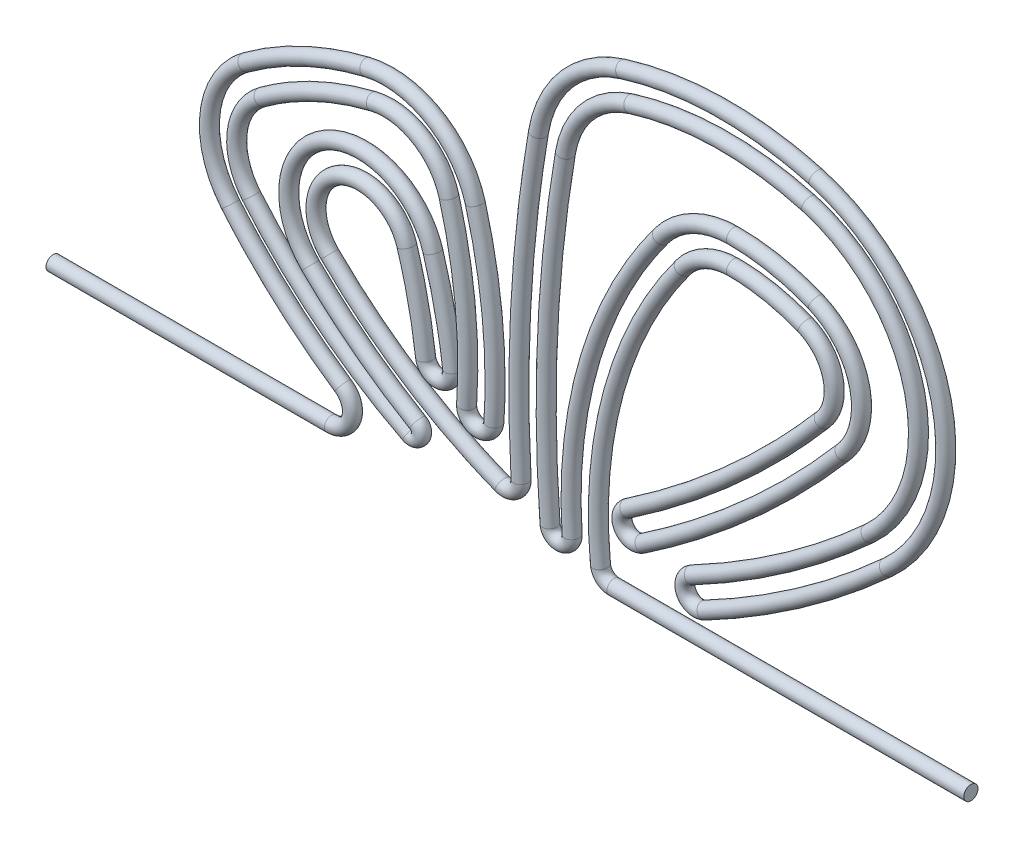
ISO-10303-21;
HEADER;
FILE_DESCRIPTION(('STEP AP214'),'2;1');
FILE_NAME('part.step','',(''),(''),'','','');
FILE_SCHEMA(('AUTOMOTIVE_DESIGN { 1 0 10303 214 1 1 1 1 }'));
ENDSEC;
DATA;
#1=APPLICATION_CONTEXT('core data for automotive mechanical design processes');
#2=APPLICATION_PROTOCOL_DEFINITION('international standard','automotive_design',2000,#1);
#3=PRODUCT_CONTEXT('',#1,'mechanical');
#4=PRODUCT('Part','Part','',(#3));
#5=PRODUCT_RELATED_PRODUCT_CATEGORY('part','',(#4));
#6=PRODUCT_DEFINITION_FORMATION('','',#4);
#7=PRODUCT_DEFINITION_CONTEXT('part definition',#1,'design');
#8=PRODUCT_DEFINITION('design','',#6,#7);
#9=PRODUCT_DEFINITION_SHAPE('','',#8);
#10=(LENGTH_UNIT() NAMED_UNIT(*) SI_UNIT(.MILLI.,.METRE.));
#11=(NAMED_UNIT(*) PLANE_ANGLE_UNIT() SI_UNIT($,.RADIAN.));
#12=(NAMED_UNIT(*) SI_UNIT($,.STERADIAN.) SOLID_ANGLE_UNIT());
#13=UNCERTAINTY_MEASURE_WITH_UNIT(LENGTH_MEASURE(1.E-05),#10,'distance_accuracy_value','');
#14=(GEOMETRIC_REPRESENTATION_CONTEXT(3) GLOBAL_UNCERTAINTY_ASSIGNED_CONTEXT((#13)) GLOBAL_UNIT_ASSIGNED_CONTEXT((#10,
#11,#12)) REPRESENTATION_CONTEXT('',''));
#15=CARTESIAN_POINT('',(0.,0.,0.));
#16=DIRECTION('',(0.,0.,1.));
#17=DIRECTION('',(1.,0.,0.));
#18=AXIS2_PLACEMENT_3D('',#15,#16,#17);
#19=CARTESIAN_POINT('',(-246.494000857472,-180.5,0.));
#20=DIRECTION('',(1.,0.,0.));
#21=DIRECTION('',(0.,1.,0.));
#22=AXIS2_PLACEMENT_3D('',#19,#20,#21);
#23=CYLINDRICAL_SURFACE('',#22,6.49999999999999);
#24=CARTESIAN_POINT('',(80.5,-180.5,0.));
#25=DIRECTION('',(-1.,0.,0.));
#26=DIRECTION('',(0.,-1.,0.));
#27=AXIS2_PLACEMENT_3D('',#24,#25,#26);
#28=CIRCLE('',#27,6.49999999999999);
#29=CARTESIAN_POINT('',(80.5,-187.,0.));
#30=VERTEX_POINT('',#29);
#31=EDGE_CURVE('E49',#30,#30,#28,.T.);
#32=ORIENTED_EDGE('',*,*,#31,.T.);
#33=EDGE_LOOP('',(#32));
#34=FACE_BOUND('',#33,.T.);
#35=CARTESIAN_POINT('',(-246.494000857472,-180.5,0.));
#36=DIRECTION('',(-1.,0.,0.));
#37=DIRECTION('',(0.,-1.,0.));
#38=AXIS2_PLACEMENT_3D('',#35,#36,#37);
#39=CIRCLE('',#38,6.49999999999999);
#40=CARTESIAN_POINT('',(-246.494000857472,-187.,0.));
#41=VERTEX_POINT('',#40);
#42=EDGE_CURVE('E12',#41,#41,#39,.T.);
#43=ORIENTED_EDGE('',*,*,#42,.F.);
#44=EDGE_LOOP('',(#43));
#45=FACE_BOUND('',#44,.T.);
#46=ADVANCED_FACE('F42',(#34,#45),#23,.T.);
#47=CARTESIAN_POINT('',(80.5,-180.5,0.));
#48=DIRECTION('',(-1.,0.,0.));
#49=DIRECTION('',(0.,-1.,0.));
#50=AXIS2_PLACEMENT_3D('',#47,#48,#49);
#51=PLANE('',#50);
#52=ORIENTED_EDGE('',*,*,#31,.F.);
#53=EDGE_LOOP('',(#52));
#54=FACE_BOUND('',#53,.T.);
#55=ADVANCED_FACE('F454',(#54),#51,.F.);
#56=CARTESIAN_POINT('',(-246.494000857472,-168.,0.));
#57=DIRECTION('',(0.,0.,1.));
#58=DIRECTION('',(1.,0.,0.));
#59=AXIS2_PLACEMENT_3D('',#56,#57,#58);
#60=TOROIDAL_SURFACE('',#59,12.5,6.49999999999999);
#61=CARTESIAN_POINT('',(-258.931237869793,-169.251053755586,0.));
#62=DIRECTION('',(-0.100084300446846,0.994978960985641,0.));
#63=DIRECTION('',(-0.994978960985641,-0.100084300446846,0.));
#64=AXIS2_PLACEMENT_3D('',#61,#62,#63);
#65=CIRCLE('',#64,6.49999999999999);
#66=CARTESIAN_POINT('',(-265.398601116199,-169.90160170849,0.));
#67=VERTEX_POINT('',#66);
#68=EDGE_CURVE('E447',#67,#67,#65,.T.);
#69=CARTESIAN_POINT('',(-246.494000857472,-168.,0.));
#70=DIRECTION('',(0.,0.,1.));
#71=DIRECTION('',(1.,0.,0.));
#72=AXIS2_PLACEMENT_3D('',#69,#70,#71);
#73=CIRCLE('',#72,18.9999999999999);
#74=EDGE_CURVE('',#67,#41,#73,.T.);
#75=ORIENTED_EDGE('',*,*,#68,.F.);
#76=ORIENTED_EDGE('',*,*,#42,.T.);
#77=ORIENTED_EDGE('',*,*,#74,.T.);
#78=ORIENTED_EDGE('',*,*,#74,.F.);
#79=EDGE_LOOP('',(#75,#77,#76,#78));
#80=FACE_BOUND('',#79,.T.);
#81=ADVANCED_FACE('F456',(#80),#60,.T.);
#82=CARTESIAN_POINT('',(131.536237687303,-129.974178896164,0.));
#83=DIRECTION('',(0.,0.,1.));
#84=DIRECTION('',(1.,0.,0.));
#85=AXIS2_PLACEMENT_3D('',#82,#83,#84);
#86=TOROIDAL_SURFACE('',#85,392.437921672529,6.49999999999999);
#87=CARTESIAN_POINT('',(-183.05574987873,104.630603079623,0.));
#88=DIRECTION('',(0.597813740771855,0.801635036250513,0.));
#89=DIRECTION('',(-0.801635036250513,0.597813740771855,0.));
#90=AXIS2_PLACEMENT_3D('',#87,#88,#89);
#91=CIRCLE('',#90,6.49999999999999);
#92=CARTESIAN_POINT('',(-188.266377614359,108.51639239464,0.));
#93=VERTEX_POINT('',#92);
#94=EDGE_CURVE('E444',#93,#93,#91,.T.);
#95=CARTESIAN_POINT('',(131.536237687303,-129.974178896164,0.));
#96=DIRECTION('',(0.,0.,1.));
#97=DIRECTION('',(1.,0.,0.));
#98=AXIS2_PLACEMENT_3D('',#95,#96,#97);
#99=CIRCLE('',#98,398.937921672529);
#100=EDGE_CURVE('',#93,#67,#99,.T.);
#101=ORIENTED_EDGE('',*,*,#94,.F.);
#102=ORIENTED_EDGE('',*,*,#68,.T.);
#103=ORIENTED_EDGE('',*,*,#100,.T.);
#104=ORIENTED_EDGE('',*,*,#100,.F.);
#105=EDGE_LOOP('',(#101,#103,#102,#104));
#106=FACE_BOUND('',#105,.T.);
#107=ADVANCED_FACE('F461',(#106),#86,.T.);
#108=CARTESIAN_POINT('',(-136.961735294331,70.2563129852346,0.));
#109=DIRECTION('',(0.,0.,1.));
#110=DIRECTION('',(1.,0.,0.));
#111=AXIS2_PLACEMENT_3D('',#108,#109,#110);
#112=TOROIDAL_SURFACE('',#111,57.5000000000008,6.49999999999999);
#113=CARTESIAN_POINT('',(-136.961735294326,127.756312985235,0.));
#114=DIRECTION('',(1.,0.,0.));
#115=DIRECTION('',(0.,1.,0.));
#116=AXIS2_PLACEMENT_3D('',#113,#114,#115);
#117=CIRCLE('',#116,6.49999999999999);
#118=CARTESIAN_POINT('',(-136.961735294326,134.256312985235,0.));
#119=VERTEX_POINT('',#118);
#120=EDGE_CURVE('E441',#119,#119,#117,.T.);
#121=CARTESIAN_POINT('',(-136.961735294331,70.2563129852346,0.));
#122=DIRECTION('',(0.,0.,1.));
#123=DIRECTION('',(1.,0.,0.));
#124=AXIS2_PLACEMENT_3D('',#121,#122,#123);
#125=CIRCLE('',#124,64.0000000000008);
#126=EDGE_CURVE('',#119,#93,#125,.T.);
#127=ORIENTED_EDGE('',*,*,#120,.F.);
#128=ORIENTED_EDGE('',*,*,#94,.T.);
#129=ORIENTED_EDGE('',*,*,#126,.T.);
#130=ORIENTED_EDGE('',*,*,#126,.F.);
#131=EDGE_LOOP('',(#127,#129,#128,#130));
#132=FACE_BOUND('',#131,.T.);
#133=ADVANCED_FACE('F467',(#132),#112,.T.);
#134=CARTESIAN_POINT('',(-136.961735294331,-46.1289182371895,0.));
#135=DIRECTION('',(0.,0.,1.));
#136=DIRECTION('',(1.,0.,0.));
#137=AXIS2_PLACEMENT_3D('',#134,#135,#136);
#138=TOROIDAL_SURFACE('',#137,173.885231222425,6.49999999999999);
#139=CARTESIAN_POINT('',(-71.1504305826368,114.821216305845,0.));
#140=DIRECTION('',(0.925611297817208,-0.378475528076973,0.));
#141=DIRECTION('',(0.378475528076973,0.925611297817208,0.));
#142=AXIS2_PLACEMENT_3D('',#139,#140,#141);
#143=CIRCLE('',#142,6.49999999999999);
#144=CARTESIAN_POINT('',(-71.1504305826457,114.821216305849,6.49999999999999));
#145=VERTEX_POINT('',#144);
#146=CARTESIAN_POINT('',(-71.1504305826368,114.821216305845,-6.49999999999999));
#147=VERTEX_POINT('',#146);
#148=EDGE_CURVE('E58',#145,#147,#143,.T.);
#149=ORIENTED_EDGE('',*,*,#148,.F.);
#150=CARTESIAN_POINT('',(-71.1504305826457,114.821216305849,0.));
#151=DIRECTION('',(-0.925611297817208,0.378475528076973,0.));
#152=DIRECTION('',(-0.378475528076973,-0.925611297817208,0.));
#153=AXIS2_PLACEMENT_3D('',#150,#151,#152);
#154=CIRCLE('',#153,6.49999999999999);
#155=EDGE_CURVE('E55',#145,#147,#154,.T.);
#156=ORIENTED_EDGE('',*,*,#155,.T.);
#157=EDGE_LOOP('',(#149,#156));
#158=FACE_BOUND('',#157,.T.);
#159=ORIENTED_EDGE('',*,*,#120,.T.);
#160=EDGE_LOOP('',(#159));
#161=FACE_BOUND('',#160,.T.);
#162=ADVANCED_FACE('F471',(#158,#161),#138,.T.);
#163=CARTESIAN_POINT('',(-87.235640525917,75.4827361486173,0.));
#164=DIRECTION('',(0.,0.,1.));
#165=DIRECTION('',(1.,0.,0.));
#166=AXIS2_PLACEMENT_3D('',#163,#164,#165);
#167=TOROIDAL_SURFACE('',#166,42.4999999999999,6.49999999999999);
#168=CARTESIAN_POINT('',(-54.8893133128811,47.915271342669,0.));
#169=DIRECTION('',(-0.648646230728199,-0.761090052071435,0.));
#170=DIRECTION('',(0.761090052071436,-0.648646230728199,0.));
#171=AXIS2_PLACEMENT_3D('',#168,#169,#170);
#172=CIRCLE('',#171,6.49999999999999);
#173=CARTESIAN_POINT('',(-54.8893133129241,47.9152713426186,6.49999999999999));
#174=VERTEX_POINT('',#173);
#175=CARTESIAN_POINT('',(-54.8893133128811,47.915271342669,-6.49999999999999));
#176=VERTEX_POINT('',#175);
#177=EDGE_CURVE('E434',#174,#176,#172,.T.);
#178=ORIENTED_EDGE('',*,*,#177,.F.);
#179=CARTESIAN_POINT('',(-54.8893133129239,47.9152713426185,0.));
#180=DIRECTION('',(0.648646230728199,0.761090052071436,0.));
#181=DIRECTION('',(-0.761090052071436,0.648646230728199,0.));
#182=AXIS2_PLACEMENT_3D('',#179,#180,#181);
#183=CIRCLE('',#182,6.49999999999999);
#184=EDGE_CURVE('E432',#174,#176,#183,.T.);
#185=ORIENTED_EDGE('',*,*,#184,.T.);
#186=EDGE_LOOP('',(#178,#185));
#187=FACE_BOUND('',#186,.T.);
#188=ORIENTED_EDGE('',*,*,#155,.F.);
#189=ORIENTED_EDGE('',*,*,#148,.T.);
#190=EDGE_LOOP('',(#188,#189));
#191=FACE_BOUND('',#190,.T.);
#192=ADVANCED_FACE('F475',(#187,#191),#167,.T.);
#193=CARTESIAN_POINT('',(-730.356734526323,623.588801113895,0.));
#194=DIRECTION('',(0.,0.,1.));
#195=DIRECTION('',(1.,0.,0.));
#196=AXIS2_PLACEMENT_3D('',#193,#194,#195);
#197=TOROIDAL_SURFACE('',#196,887.5,6.49999999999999);
#198=CARTESIAN_POINT('',(-233.814526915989,-112.007614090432,0.));
#199=DIRECTION('',(-0.828841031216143,-0.559484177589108,0.));
#200=DIRECTION('',(0.559484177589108,-0.828841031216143,0.));
#201=AXIS2_PLACEMENT_3D('',#198,#199,#200);
#202=CIRCLE('',#201,6.49999999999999);
#203=CARTESIAN_POINT('',(-233.814526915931,-112.007614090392,6.49999999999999));
#204=VERTEX_POINT('',#203);
#205=CARTESIAN_POINT('',(-233.814526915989,-112.007614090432,-6.49999999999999));
#206=VERTEX_POINT('',#205);
#207=EDGE_CURVE('E429',#204,#206,#202,.T.);
#208=ORIENTED_EDGE('',*,*,#207,.F.);
#209=CARTESIAN_POINT('',(-233.814526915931,-112.007614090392,0.));
#210=DIRECTION('',(0.828841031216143,0.559484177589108,0.));
#211=DIRECTION('',(-0.559484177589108,0.828841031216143,0.));
#212=AXIS2_PLACEMENT_3D('',#209,#210,#211);
#213=CIRCLE('',#212,6.49999999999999);
#214=EDGE_CURVE('E427',#204,#206,#213,.T.);
#215=ORIENTED_EDGE('',*,*,#214,.T.);
#216=EDGE_LOOP('',(#208,#215));
#217=FACE_BOUND('',#216,.T.);
#218=ORIENTED_EDGE('',*,*,#184,.F.);
#219=ORIENTED_EDGE('',*,*,#177,.T.);
#220=EDGE_LOOP('',(#218,#219));
#221=FACE_BOUND('',#220,.T.);
#222=ADVANCED_FACE('F478',(#217,#221),#197,.T.);
#223=CARTESIAN_POINT('',(-226.820974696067,-122.368126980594,0.));
#224=DIRECTION('',(0.,0.,-1.));
#225=DIRECTION('',(-1.,0.,0.));
#226=AXIS2_PLACEMENT_3D('',#223,#224,#225);
#227=TOROIDAL_SURFACE('',#226,12.4999999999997,6.49999999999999);
#228=CARTESIAN_POINT('',(-219.827422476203,-132.728639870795,0.));
#229=DIRECTION('',(0.828841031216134,0.559484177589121,0.));
#230=DIRECTION('',(-0.559484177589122,0.828841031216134,0.));
#231=AXIS2_PLACEMENT_3D('',#228,#229,#230);
#232=CIRCLE('',#231,6.49999999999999);
#233=CARTESIAN_POINT('',(-219.827422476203,-132.728639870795,6.49999999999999));
#234=VERTEX_POINT('',#233);
#235=CARTESIAN_POINT('',(-219.82742247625,-132.728639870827,-6.49999999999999));
#236=VERTEX_POINT('',#235);
#237=EDGE_CURVE('E424',#234,#236,#232,.T.);
#238=ORIENTED_EDGE('',*,*,#237,.F.);
#239=CARTESIAN_POINT('',(-219.827422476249,-132.728639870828,0.));
#240=DIRECTION('',(-0.828841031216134,-0.559484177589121,0.));
#241=DIRECTION('',(0.559484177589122,-0.828841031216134,0.));
#242=AXIS2_PLACEMENT_3D('',#239,#240,#241);
#243=CIRCLE('',#242,6.49999999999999);
#244=EDGE_CURVE('E422',#234,#236,#243,.T.);
#245=ORIENTED_EDGE('',*,*,#244,.T.);
#246=EDGE_LOOP('',(#238,#245));
#247=FACE_BOUND('',#246,.T.);
#248=ORIENTED_EDGE('',*,*,#214,.F.);
#249=ORIENTED_EDGE('',*,*,#207,.T.);
#250=EDGE_LOOP('',(#248,#249));
#251=FACE_BOUND('',#250,.T.);
#252=ADVANCED_FACE('F482',(#247,#251),#227,.T.);
#253=CARTESIAN_POINT('',(-730.356734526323,623.588801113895,0.));
#254=DIRECTION('',(0.,0.,-1.));
#255=DIRECTION('',(-1.,0.,0.));
#256=AXIS2_PLACEMENT_3D('',#253,#254,#255);
#257=TOROIDAL_SURFACE('',#256,912.5,6.49999999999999);
#258=CARTESIAN_POINT('',(-35.8620620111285,31.6991155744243,0.));
#259=DIRECTION('',(0.648646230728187,0.761090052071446,0.));
#260=DIRECTION('',(-0.761090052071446,0.648646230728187,0.));
#261=AXIS2_PLACEMENT_3D('',#258,#259,#260);
#262=CIRCLE('',#261,6.49999999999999);
#263=CARTESIAN_POINT('',(-35.8620620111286,31.6991155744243,6.49999999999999));
#264=VERTEX_POINT('',#263);
#265=CARTESIAN_POINT('',(-35.8620620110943,31.6991155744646,-6.49999999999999));
#266=VERTEX_POINT('',#265);
#267=EDGE_CURVE('E419',#264,#266,#262,.T.);
#268=ORIENTED_EDGE('',*,*,#267,.F.);
#269=CARTESIAN_POINT('',(-35.8620620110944,31.6991155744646,0.));
#270=DIRECTION('',(-0.648646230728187,-0.761090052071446,0.));
#271=DIRECTION('',(0.761090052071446,-0.648646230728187,0.));
#272=AXIS2_PLACEMENT_3D('',#269,#270,#271);
#273=CIRCLE('',#272,6.49999999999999);
#274=EDGE_CURVE('E417',#264,#266,#273,.T.);
#275=ORIENTED_EDGE('',*,*,#274,.T.);
#276=EDGE_LOOP('',(#268,#275));
#277=FACE_BOUND('',#276,.T.);
#278=ORIENTED_EDGE('',*,*,#244,.F.);
#279=ORIENTED_EDGE('',*,*,#237,.T.);
#280=EDGE_LOOP('',(#278,#279));
#281=FACE_BOUND('',#280,.T.);
#282=ADVANCED_FACE('F486',(#277,#281),#257,.T.);
#283=CARTESIAN_POINT('',(-87.235640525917,75.4827361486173,0.));
#284=DIRECTION('',(0.,0.,-1.));
#285=DIRECTION('',(-1.,0.,0.));
#286=AXIS2_PLACEMENT_3D('',#283,#284,#285);
#287=TOROIDAL_SURFACE('',#286,67.5000000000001,6.49999999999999);
#288=CARTESIAN_POINT('',(-61.6885423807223,137.961498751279,0.));
#289=DIRECTION('',(-0.925611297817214,0.378475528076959,0.));
#290=DIRECTION('',(-0.378475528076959,-0.925611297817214,0.));
#291=AXIS2_PLACEMENT_3D('',#288,#289,#290);
#292=CIRCLE('',#291,6.49999999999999);
#293=CARTESIAN_POINT('',(-61.6885423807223,137.961498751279,6.49999999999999));
#294=VERTEX_POINT('',#293);
#295=CARTESIAN_POINT('',(-61.6885423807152,137.961498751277,-6.49999999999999));
#296=VERTEX_POINT('',#295);
#297=EDGE_CURVE('E414',#294,#296,#292,.T.);
#298=ORIENTED_EDGE('',*,*,#297,.F.);
#299=CARTESIAN_POINT('',(-61.6885423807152,137.961498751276,0.));
#300=DIRECTION('',(0.925611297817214,-0.378475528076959,0.));
#301=DIRECTION('',(0.378475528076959,0.925611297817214,0.));
#302=AXIS2_PLACEMENT_3D('',#299,#300,#301);
#303=CIRCLE('',#302,6.49999999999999);
#304=EDGE_CURVE('E412',#294,#296,#303,.T.);
#305=ORIENTED_EDGE('',*,*,#304,.T.);
#306=EDGE_LOOP('',(#298,#305));
#307=FACE_BOUND('',#306,.T.);
#308=ORIENTED_EDGE('',*,*,#274,.F.);
#309=ORIENTED_EDGE('',*,*,#267,.T.);
#310=EDGE_LOOP('',(#308,#309));
#311=FACE_BOUND('',#310,.T.);
#312=ADVANCED_FACE('F490',(#307,#311),#287,.T.);
#313=CARTESIAN_POINT('',(-136.961735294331,-46.1289182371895,0.));
#314=DIRECTION('',(0.,0.,-1.));
#315=DIRECTION('',(-1.,0.,0.));
#316=AXIS2_PLACEMENT_3D('',#313,#314,#315);
#317=TOROIDAL_SURFACE('',#316,198.885231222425,6.49999999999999);
#318=CARTESIAN_POINT('',(-136.961735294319,152.756312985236,0.));
#319=DIRECTION('',(-1.,0.,0.));
#320=DIRECTION('',(0.,-1.,0.));
#321=AXIS2_PLACEMENT_3D('',#318,#319,#320);
#322=CIRCLE('',#321,6.49999999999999);
#323=CARTESIAN_POINT('',(-136.961735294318,159.256312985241,0.));
#324=VERTEX_POINT('',#323);
#325=EDGE_CURVE('E411',#324,#324,#322,.T.);
#326=ORIENTED_EDGE('',*,*,#325,.F.);
#327=EDGE_LOOP('',(#326));
#328=FACE_BOUND('',#327,.T.);
#329=ORIENTED_EDGE('',*,*,#304,.F.);
#330=ORIENTED_EDGE('',*,*,#297,.T.);
#331=EDGE_LOOP('',(#329,#330));
#332=FACE_BOUND('',#331,.T.);
#333=ADVANCED_FACE('F494',(#328,#332),#317,.T.);
#334=CARTESIAN_POINT('',(-136.961735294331,70.2563129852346,0.));
#335=DIRECTION('',(0.,0.,-1.));
#336=DIRECTION('',(-1.,0.,0.));
#337=AXIS2_PLACEMENT_3D('',#334,#335,#336);
#338=TOROIDAL_SURFACE('',#337,82.500000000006,6.49999999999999);
#339=CARTESIAN_POINT('',(-203.096625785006,119.575946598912,0.));
#340=DIRECTION('',(-0.597813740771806,-0.801635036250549,0.));
#341=DIRECTION('',(0.801635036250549,-0.597813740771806,0.));
#342=AXIS2_PLACEMENT_3D('',#339,#340,#341);
#343=CIRCLE('',#342,6.49999999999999);
#344=CARTESIAN_POINT('',(-208.307253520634,123.461735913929,0.));
#345=VERTEX_POINT('',#344);
#346=EDGE_CURVE('E408',#345,#345,#343,.T.);
#347=CARTESIAN_POINT('',(-136.961735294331,70.2563129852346,0.));
#348=DIRECTION('',(0.,0.,-1.));
#349=DIRECTION('',(-1.,0.,0.));
#350=AXIS2_PLACEMENT_3D('',#347,#348,#349);
#351=CIRCLE('',#350,89.000000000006);
#352=EDGE_CURVE('',#345,#324,#351,.T.);
#353=ORIENTED_EDGE('',*,*,#346,.F.);
#354=ORIENTED_EDGE('',*,*,#325,.T.);
#355=ORIENTED_EDGE('',*,*,#352,.T.);
#356=ORIENTED_EDGE('',*,*,#352,.F.);
#357=EDGE_LOOP('',(#353,#355,#354,#356));
#358=FACE_BOUND('',#357,.T.);
#359=ADVANCED_FACE('F498',(#358),#338,.T.);
#360=CARTESIAN_POINT('',(131.536237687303,-129.974178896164,0.));
#361=DIRECTION('',(0.,0.,-1.));
#362=DIRECTION('',(-1.,0.,0.));
#363=AXIS2_PLACEMENT_3D('',#360,#361,#362);
#364=TOROIDAL_SURFACE('',#363,417.437921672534,6.49999999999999);
#365=CARTESIAN_POINT('',(-284.938766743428,-158.311241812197,0.));
#366=DIRECTION('',(0.0678832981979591,-0.997693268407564,0.));
#367=DIRECTION('',(0.997693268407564,0.0678832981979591,0.));
#368=AXIS2_PLACEMENT_3D('',#365,#366,#367);
#369=CIRCLE('',#368,6.49999999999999);
#370=CARTESIAN_POINT('',(-284.938766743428,-158.311241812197,6.49999999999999));
#371=VERTEX_POINT('',#370);
#372=CARTESIAN_POINT('',(-284.938766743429,-158.311241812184,-6.49999999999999));
#373=VERTEX_POINT('',#372);
#374=EDGE_CURVE('E403',#371,#373,#369,.T.);
#375=ORIENTED_EDGE('',*,*,#374,.F.);
#376=CARTESIAN_POINT('',(-284.938766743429,-158.311241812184,0.));
#377=DIRECTION('',(-0.0678832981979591,0.997693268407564,0.));
#378=DIRECTION('',(-0.997693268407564,-0.0678832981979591,0.));
#379=AXIS2_PLACEMENT_3D('',#376,#377,#378);
#380=CIRCLE('',#379,6.49999999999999);
#381=EDGE_CURVE('E401',#371,#373,#380,.T.);
#382=ORIENTED_EDGE('',*,*,#381,.T.);
#383=EDGE_LOOP('',(#375,#382));
#384=FACE_BOUND('',#383,.T.);
#385=ORIENTED_EDGE('',*,*,#346,.T.);
#386=EDGE_LOOP('',(#385));
#387=FACE_BOUND('',#386,.T.);
#388=ADVANCED_FACE('F502',(#384,#387),#364,.T.);
#389=CARTESIAN_POINT('',(-295.061571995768,-159.,0.));
#390=DIRECTION('',(0.,0.,1.));
#391=DIRECTION('',(1.,0.,0.));
#392=AXIS2_PLACEMENT_3D('',#389,#390,#391);
#393=TOROIDAL_SURFACE('',#392,10.1462098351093,6.49999999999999);
#394=CARTESIAN_POINT('',(-305.179024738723,-159.763363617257,0.));
#395=DIRECTION('',(-0.0752363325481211,0.997165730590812,0.));
#396=DIRECTION('',(-0.997165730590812,-0.0752363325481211,0.));
#397=AXIS2_PLACEMENT_3D('',#394,#395,#396);
#398=CIRCLE('',#397,6.49999999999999);
#399=CARTESIAN_POINT('',(-305.17902473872,-159.763363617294,6.49999999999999));
#400=VERTEX_POINT('',#399);
#401=CARTESIAN_POINT('',(-305.179024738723,-159.763363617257,-6.49999999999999));
#402=VERTEX_POINT('',#401);
#403=EDGE_CURVE('E398',#400,#402,#398,.T.);
#404=ORIENTED_EDGE('',*,*,#403,.F.);
#405=CARTESIAN_POINT('',(-305.17902473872,-159.763363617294,0.));
#406=DIRECTION('',(0.0752363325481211,-0.997165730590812,0.));
#407=DIRECTION('',(0.997165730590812,0.0752363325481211,0.));
#408=AXIS2_PLACEMENT_3D('',#405,#406,#407);
#409=CIRCLE('',#408,6.49999999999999);
#410=EDGE_CURVE('E396',#400,#402,#409,.T.);
#411=ORIENTED_EDGE('',*,*,#410,.T.);
#412=EDGE_LOOP('',(#404,#411));
#413=FACE_BOUND('',#412,.T.);
#414=ORIENTED_EDGE('',*,*,#381,.F.);
#415=ORIENTED_EDGE('',*,*,#374,.T.);
#416=EDGE_LOOP('',(#414,#415));
#417=FACE_BOUND('',#416,.T.);
#418=ADVANCED_FACE('F506',(#413,#417),#393,.T.);
#419=CARTESIAN_POINT('',(928.813566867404,-66.6584020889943,0.));
#420=DIRECTION('',(0.,0.,1.));
#421=DIRECTION('',(1.,0.,0.));
#422=AXIS2_PLACEMENT_3D('',#419,#420,#421);
#423=TOROIDAL_SURFACE('',#422,1237.49999999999,6.49999999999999);
#424=CARTESIAN_POINT('',(-291.019048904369,141.703397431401,0.));
#425=DIRECTION('',(0.168373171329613,0.985723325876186,0.));
#426=DIRECTION('',(-0.985723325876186,0.168373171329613,0.));
#427=AXIS2_PLACEMENT_3D('',#424,#425,#426);
#428=CIRCLE('',#427,6.49999999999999);
#429=CARTESIAN_POINT('',(-297.426250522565,142.797823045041,0.));
#430=VERTEX_POINT('',#429);
#431=EDGE_CURVE('E395',#430,#430,#428,.T.);
#432=ORIENTED_EDGE('',*,*,#431,.F.);
#433=EDGE_LOOP('',(#432));
#434=FACE_BOUND('',#433,.T.);
#435=ORIENTED_EDGE('',*,*,#410,.F.);
#436=ORIENTED_EDGE('',*,*,#403,.T.);
#437=EDGE_LOOP('',(#435,#436));
#438=FACE_BOUND('',#437,.T.);
#439=ADVANCED_FACE('F510',(#434,#438),#423,.T.);
#440=CARTESIAN_POINT('',(-204.768257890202,126.970744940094,0.));
#441=DIRECTION('',(0.,0.,1.));
#442=DIRECTION('',(1.,0.,0.));
#443=AXIS2_PLACEMENT_3D('',#440,#441,#442);
#444=TOROIDAL_SURFACE('',#443,87.499999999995,6.49999999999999);
#445=CARTESIAN_POINT('',(-230.813627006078,210.504503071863,0.));
#446=DIRECTION('',(0.954671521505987,0.297661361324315,0.));
#447=DIRECTION('',(-0.297661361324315,0.954671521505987,0.));
#448=AXIS2_PLACEMENT_3D('',#445,#446,#447);
#449=CIRCLE('',#448,6.49999999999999);
#450=CARTESIAN_POINT('',(-232.748425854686,216.709867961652,0.));
#451=VERTEX_POINT('',#450);
#452=EDGE_CURVE('E392',#451,#451,#449,.T.);
#453=CARTESIAN_POINT('',(-204.768257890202,126.970744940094,0.));
#454=DIRECTION('',(0.,0.,1.));
#455=DIRECTION('',(1.,0.,0.));
#456=AXIS2_PLACEMENT_3D('',#453,#454,#455);
#457=CIRCLE('',#456,93.999999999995);
#458=EDGE_CURVE('',#451,#430,#457,.T.);
#459=ORIENTED_EDGE('',*,*,#452,.F.);
#460=ORIENTED_EDGE('',*,*,#431,.T.);
#461=ORIENTED_EDGE('',*,*,#458,.T.);
#462=ORIENTED_EDGE('',*,*,#458,.F.);
#463=EDGE_LOOP('',(#459,#461,#460,#462));
#464=FACE_BOUND('',#463,.T.);
#465=ADVANCED_FACE('F514',(#464),#444,.T.);
#466=CARTESIAN_POINT('',(-145.235985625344,-63.9635593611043,0.));
#467=DIRECTION('',(0.,0.,1.));
#468=DIRECTION('',(1.,0.,0.));
#469=AXIS2_PLACEMENT_3D('',#466,#467,#468);
#470=TOROIDAL_SURFACE('',#469,287.499999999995,6.49999999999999);
#471=CARTESIAN_POINT('',(-68.2214157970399,213.029231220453,0.));
#472=DIRECTION('',(0.96345318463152,-0.267876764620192,0.));
#473=DIRECTION('',(0.267876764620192,0.96345318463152,0.));
#474=AXIS2_PLACEMENT_3D('',#471,#472,#473);
#475=CIRCLE('',#474,6.49999999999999);
#476=CARTESIAN_POINT('',(-68.2214157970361,213.029231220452,6.49999999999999));
#477=VERTEX_POINT('',#476);
#478=CARTESIAN_POINT('',(-68.2214157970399,213.029231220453,-6.49999999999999));
#479=VERTEX_POINT('',#478);
#480=EDGE_CURVE('E387',#477,#479,#475,.T.);
#481=ORIENTED_EDGE('',*,*,#480,.F.);
#482=CARTESIAN_POINT('',(-68.2214157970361,213.029231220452,0.));
#483=DIRECTION('',(-0.96345318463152,0.267876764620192,0.));
#484=DIRECTION('',(-0.267876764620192,-0.96345318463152,0.));
#485=AXIS2_PLACEMENT_3D('',#482,#483,#484);
#486=CIRCLE('',#485,6.49999999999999);
#487=EDGE_CURVE('E385',#477,#479,#486,.T.);
#488=ORIENTED_EDGE('',*,*,#487,.T.);
#489=EDGE_LOOP('',(#481,#488));
#490=FACE_BOUND('',#489,.T.);
#491=ORIENTED_EDGE('',*,*,#452,.T.);
#492=EDGE_LOOP('',(#491));
#493=FACE_BOUND('',#492,.T.);
#494=ADVANCED_FACE('F518',(#490,#493),#470,.T.);
#495=CARTESIAN_POINT('',(-105.07440131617,80.4827361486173,0.));
#496=DIRECTION('',(0.,0.,1.));
#497=DIRECTION('',(1.,0.,0.));
#498=AXIS2_PLACEMENT_3D('',#495,#496,#497);
#499=TOROIDAL_SURFACE('',#498,137.574401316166,6.49999999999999);
#500=CARTESIAN_POINT('',(-12.3919937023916,-21.1867637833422,0.));
#501=DIRECTION('',(-0.739014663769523,-0.673689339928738,0.));
#502=DIRECTION('',(0.673689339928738,-0.739014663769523,0.));
#503=AXIS2_PLACEMENT_3D('',#500,#501,#502);
#504=CIRCLE('',#503,6.49999999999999);
#505=CARTESIAN_POINT('',(-12.3919937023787,-21.1867637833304,6.49999999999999));
#506=VERTEX_POINT('',#505);
#507=CARTESIAN_POINT('',(-12.3919937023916,-21.1867637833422,-6.49999999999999));
#508=VERTEX_POINT('',#507);
#509=EDGE_CURVE('E382',#506,#508,#504,.T.);
#510=ORIENTED_EDGE('',*,*,#509,.F.);
#511=CARTESIAN_POINT('',(-12.3919937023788,-21.1867637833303,0.));
#512=DIRECTION('',(0.739014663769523,0.673689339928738,0.));
#513=DIRECTION('',(-0.673689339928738,0.739014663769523,0.));
#514=AXIS2_PLACEMENT_3D('',#511,#512,#513);
#515=CIRCLE('',#514,6.49999999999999);
#516=EDGE_CURVE('E380',#506,#508,#515,.T.);
#517=ORIENTED_EDGE('',*,*,#516,.T.);
#518=EDGE_LOOP('',(#510,#517));
#519=FACE_BOUND('',#518,.T.);
#520=ORIENTED_EDGE('',*,*,#487,.F.);
#521=ORIENTED_EDGE('',*,*,#480,.T.);
#522=EDGE_LOOP('',(#520,#521));
#523=FACE_BOUND('',#522,.T.);
#524=ADVANCED_FACE('F522',(#519,#523),#499,.T.);
#525=CARTESIAN_POINT('',(-542.922348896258,560.787283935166,0.));
#526=DIRECTION('',(0.,0.,1.));
#527=DIRECTION('',(1.,0.,0.));
#528=AXIS2_PLACEMENT_3D('',#525,#526,#527);
#529=TOROIDAL_SURFACE('',#528,787.499999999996,6.49999999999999);
#530=CARTESIAN_POINT('',(-174.938934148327,-135.448636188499,0.));
#531=DIRECTION('',(-0.884109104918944,-0.467280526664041,0.));
#532=DIRECTION('',(0.467280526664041,-0.884109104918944,0.));
#533=AXIS2_PLACEMENT_3D('',#530,#531,#532);
#534=CIRCLE('',#533,6.49999999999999);
#535=CARTESIAN_POINT('',(-174.938934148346,-135.448636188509,6.49999999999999));
#536=VERTEX_POINT('',#535);
#537=CARTESIAN_POINT('',(-174.938934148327,-135.448636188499,-6.49999999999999));
#538=VERTEX_POINT('',#537);
#539=EDGE_CURVE('E377',#536,#538,#534,.T.);
#540=ORIENTED_EDGE('',*,*,#539,.F.);
#541=CARTESIAN_POINT('',(-174.938934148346,-135.448636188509,0.));
#542=DIRECTION('',(0.884109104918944,0.467280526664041,0.));
#543=DIRECTION('',(-0.467280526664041,0.884109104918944,0.));
#544=AXIS2_PLACEMENT_3D('',#541,#542,#543);
#545=CIRCLE('',#544,6.49999999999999);
#546=EDGE_CURVE('E375',#536,#538,#545,.T.);
#547=ORIENTED_EDGE('',*,*,#546,.T.);
#548=EDGE_LOOP('',(#540,#547));
#549=FACE_BOUND('',#548,.T.);
#550=ORIENTED_EDGE('',*,*,#516,.F.);
#551=ORIENTED_EDGE('',*,*,#509,.T.);
#552=EDGE_LOOP('',(#550,#551));
#553=FACE_BOUND('',#552,.T.);
#554=ADVANCED_FACE('F526',(#549,#553),#529,.T.);
#555=CARTESIAN_POINT('',(-169.097927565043,-146.5,0.));
#556=DIRECTION('',(0.,0.,-1.));
#557=DIRECTION('',(-1.,0.,0.));
#558=AXIS2_PLACEMENT_3D('',#555,#556,#557);
#559=TOROIDAL_SURFACE('',#558,12.5000000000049,6.49999999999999);
#560=CARTESIAN_POINT('',(-163.25692098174,-157.551363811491,0.));
#561=DIRECTION('',(0.884109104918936,0.467280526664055,0.));
#562=DIRECTION('',(-0.467280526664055,0.884109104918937,0.));
#563=AXIS2_PLACEMENT_3D('',#560,#561,#562);
#564=CIRCLE('',#563,6.49999999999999);
#565=CARTESIAN_POINT('',(-163.25692098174,-157.551363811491,6.49999999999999));
#566=VERTEX_POINT('',#565);
#567=CARTESIAN_POINT('',(-163.25692098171,-157.551363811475,-6.49999999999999));
#568=VERTEX_POINT('',#567);
#569=EDGE_CURVE('E372',#566,#568,#564,.T.);
#570=ORIENTED_EDGE('',*,*,#569,.F.);
#571=CARTESIAN_POINT('',(-163.25692098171,-157.551363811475,0.));
#572=DIRECTION('',(-0.884109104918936,-0.467280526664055,0.));
#573=DIRECTION('',(0.467280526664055,-0.884109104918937,0.));
#574=AXIS2_PLACEMENT_3D('',#571,#572,#573);
#575=CIRCLE('',#574,6.49999999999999);
#576=EDGE_CURVE('E370',#566,#568,#575,.T.);
#577=ORIENTED_EDGE('',*,*,#576,.T.);
#578=EDGE_LOOP('',(#570,#577));
#579=FACE_BOUND('',#578,.T.);
#580=ORIENTED_EDGE('',*,*,#546,.F.);
#581=ORIENTED_EDGE('',*,*,#539,.T.);
#582=EDGE_LOOP('',(#580,#581));
#583=FACE_BOUND('',#582,.T.);
#584=ADVANCED_FACE('F530',(#579,#583),#559,.T.);
#585=CARTESIAN_POINT('',(-542.922348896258,560.787283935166,0.));
#586=DIRECTION('',(0.,0.,-1.));
#587=DIRECTION('',(-1.,0.,0.));
#588=AXIS2_PLACEMENT_3D('',#585,#586,#587);
#589=TOROIDAL_SURFACE('',#588,812.500000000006,6.49999999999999);
#590=CARTESIAN_POINT('',(4.45023979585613,-39.6621303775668,0.));
#591=DIRECTION('',(0.739014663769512,0.67368933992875,0.));
#592=DIRECTION('',(-0.67368933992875,0.739014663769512,0.));
#593=AXIS2_PLACEMENT_3D('',#590,#591,#592);
#594=CIRCLE('',#593,6.49999999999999);
#595=CARTESIAN_POINT('',(4.45023979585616,-39.6621303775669,6.49999999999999));
#596=VERTEX_POINT('',#595);
#597=CARTESIAN_POINT('',(4.45023979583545,-39.6621303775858,-6.49999999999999));
#598=VERTEX_POINT('',#597);
#599=EDGE_CURVE('E367',#596,#598,#594,.T.);
#600=ORIENTED_EDGE('',*,*,#599,.F.);
#601=CARTESIAN_POINT('',(4.45023979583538,-39.6621303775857,0.));
#602=DIRECTION('',(-0.739014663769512,-0.67368933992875,0.));
#603=DIRECTION('',(0.67368933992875,-0.739014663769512,0.));
#604=AXIS2_PLACEMENT_3D('',#601,#602,#603);
#605=CIRCLE('',#604,6.49999999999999);
#606=EDGE_CURVE('E365',#596,#598,#605,.T.);
#607=ORIENTED_EDGE('',*,*,#606,.T.);
#608=EDGE_LOOP('',(#600,#607));
#609=FACE_BOUND('',#608,.T.);
#610=ORIENTED_EDGE('',*,*,#576,.F.);
#611=ORIENTED_EDGE('',*,*,#569,.T.);
#612=EDGE_LOOP('',(#610,#611));
#613=FACE_BOUND('',#612,.T.);
#614=ADVANCED_FACE('F534',(#609,#613),#589,.T.);
#615=CARTESIAN_POINT('',(-105.07440131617,80.4827361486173,0.));
#616=DIRECTION('',(0.,0.,-1.));
#617=DIRECTION('',(-1.,0.,0.));
#618=AXIS2_PLACEMENT_3D('',#615,#616,#617);
#619=TOROIDAL_SURFACE('',#618,162.574401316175,6.49999999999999);
#620=CARTESIAN_POINT('',(-61.5244966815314,237.11556083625,0.));
#621=DIRECTION('',(-0.963453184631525,0.267876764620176,0.));
#622=DIRECTION('',(-0.267876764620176,-0.963453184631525,0.));
#623=AXIS2_PLACEMENT_3D('',#620,#621,#622);
#624=CIRCLE('',#623,6.49999999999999);
#625=CARTESIAN_POINT('',(-61.5244966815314,237.11556083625,6.49999999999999));
#626=VERTEX_POINT('',#625);
#627=CARTESIAN_POINT('',(-61.5244966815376,237.115560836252,-6.49999999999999));
#628=VERTEX_POINT('',#627);
#629=EDGE_CURVE('E362',#626,#628,#624,.T.);
#630=ORIENTED_EDGE('',*,*,#629,.F.);
#631=CARTESIAN_POINT('',(-61.5244966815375,237.115560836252,0.));
#632=DIRECTION('',(0.963453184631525,-0.267876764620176,0.));
#633=DIRECTION('',(0.267876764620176,0.963453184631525,0.));
#634=AXIS2_PLACEMENT_3D('',#631,#632,#633);
#635=CIRCLE('',#634,6.49999999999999);
#636=EDGE_CURVE('E360',#626,#628,#635,.T.);
#637=ORIENTED_EDGE('',*,*,#636,.T.);
#638=EDGE_LOOP('',(#630,#637));
#639=FACE_BOUND('',#638,.T.);
#640=ORIENTED_EDGE('',*,*,#606,.F.);
#641=ORIENTED_EDGE('',*,*,#599,.T.);
#642=EDGE_LOOP('',(#640,#641));
#643=FACE_BOUND('',#642,.T.);
#644=ADVANCED_FACE('F538',(#639,#643),#619,.T.);
#645=CARTESIAN_POINT('',(-145.235985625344,-63.9635593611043,0.));
#646=DIRECTION('',(0.,0.,-1.));
#647=DIRECTION('',(-1.,0.,0.));
#648=AXIS2_PLACEMENT_3D('',#645,#646,#647);
#649=TOROIDAL_SURFACE('',#648,312.500000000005,6.49999999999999);
#650=CARTESIAN_POINT('',(-238.255161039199,234.371291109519,0.));
#651=DIRECTION('',(-0.954671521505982,-0.297661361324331,0.));
#652=DIRECTION('',(0.297661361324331,-0.954671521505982,0.));
#653=AXIS2_PLACEMENT_3D('',#650,#651,#652);
#654=CIRCLE('',#653,6.49999999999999);
#655=CARTESIAN_POINT('',(-240.189959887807,240.576655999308,0.));
#656=VERTEX_POINT('',#655);
#657=EDGE_CURVE('E359',#656,#656,#654,.T.);
#658=ORIENTED_EDGE('',*,*,#657,.F.);
#659=EDGE_LOOP('',(#658));
#660=FACE_BOUND('',#659,.T.);
#661=ORIENTED_EDGE('',*,*,#636,.F.);
#662=ORIENTED_EDGE('',*,*,#629,.T.);
#663=EDGE_LOOP('',(#661,#662));
#664=FACE_BOUND('',#663,.T.);
#665=ADVANCED_FACE('F542',(#660,#664),#649,.T.);
#666=CARTESIAN_POINT('',(-204.768257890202,126.970744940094,0.));
#667=DIRECTION('',(0.,0.,-1.));
#668=DIRECTION('',(-1.,0.,0.));
#669=AXIS2_PLACEMENT_3D('',#666,#667,#668);
#670=TOROIDAL_SURFACE('',#669,112.500000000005,6.49999999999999);
#671=CARTESIAN_POINT('',(-315.662132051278,145.912726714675,0.));
#672=DIRECTION('',(-0.168373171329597,-0.985723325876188,0.));
#673=DIRECTION('',(0.985723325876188,-0.168373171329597,0.));
#674=AXIS2_PLACEMENT_3D('',#671,#672,#673);
#675=CIRCLE('',#674,6.49999999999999);
#676=CARTESIAN_POINT('',(-322.069333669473,147.007152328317,0.));
#677=VERTEX_POINT('',#676);
#678=EDGE_CURVE('E356',#677,#677,#675,.T.);
#679=CARTESIAN_POINT('',(-204.768257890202,126.970744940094,0.));
#680=DIRECTION('',(0.,0.,-1.));
#681=DIRECTION('',(-1.,0.,0.));
#682=AXIS2_PLACEMENT_3D('',#679,#680,#681);
#683=CIRCLE('',#682,119.000000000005);
#684=EDGE_CURVE('',#677,#656,#683,.T.);
#685=ORIENTED_EDGE('',*,*,#678,.F.);
#686=ORIENTED_EDGE('',*,*,#657,.T.);
#687=ORIENTED_EDGE('',*,*,#684,.T.);
#688=ORIENTED_EDGE('',*,*,#684,.F.);
#689=EDGE_LOOP('',(#685,#687,#686,#688));
#690=FACE_BOUND('',#689,.T.);
#691=ADVANCED_FACE('F546',(#690),#670,.T.);
#692=CARTESIAN_POINT('',(928.813566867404,-66.6584020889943,0.));
#693=DIRECTION('',(0.,0.,-1.));
#694=DIRECTION('',(-1.,0.,0.));
#695=AXIS2_PLACEMENT_3D('',#692,#693,#694);
#696=TOROIDAL_SURFACE('',#695,1262.5,6.49999999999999);
#697=CARTESIAN_POINT('',(-331.676488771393,-137.869845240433,0.));
#698=DIRECTION('',(0.0564051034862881,-0.998407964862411,0.));
#699=DIRECTION('',(0.998407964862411,0.0564051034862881,0.));
#700=AXIS2_PLACEMENT_3D('',#697,#698,#699);
#701=CIRCLE('',#700,6.49999999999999);
#702=CARTESIAN_POINT('',(-331.676488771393,-137.869845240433,6.49999999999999));
#703=VERTEX_POINT('',#702);
#704=CARTESIAN_POINT('',(-331.676488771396,-137.869845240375,-6.49999999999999));
#705=VERTEX_POINT('',#704);
#706=EDGE_CURVE('E351',#703,#705,#701,.T.);
#707=ORIENTED_EDGE('',*,*,#706,.F.);
#708=CARTESIAN_POINT('',(-331.676488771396,-137.869845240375,0.));
#709=DIRECTION('',(-0.0564051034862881,0.998407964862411,0.));
#710=DIRECTION('',(-0.998407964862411,-0.0564051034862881,0.));
#711=AXIS2_PLACEMENT_3D('',#708,#709,#710);
#712=CIRCLE('',#711,6.49999999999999);
#713=EDGE_CURVE('E349',#703,#705,#712,.T.);
#714=ORIENTED_EDGE('',*,*,#713,.T.);
#715=EDGE_LOOP('',(#707,#714));
#716=FACE_BOUND('',#715,.T.);
#717=ORIENTED_EDGE('',*,*,#678,.T.);
#718=EDGE_LOOP('',(#717));
#719=FACE_BOUND('',#718,.T.);
#720=ADVANCED_FACE('F550',(#716,#719),#696,.T.);
#721=CARTESIAN_POINT('',(-344.156588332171,-138.574909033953,0.));
#722=DIRECTION('',(0.,0.,1.));
#723=DIRECTION('',(1.,0.,0.));
#724=AXIS2_PLACEMENT_3D('',#721,#722,#723);
#725=TOROIDAL_SURFACE('',#724,12.4999999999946,6.49999999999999);
#726=CARTESIAN_POINT('',(-348.73080469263,-150.207902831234,0.));
#727=DIRECTION('',(-0.93063950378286,0.3659373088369,0.));
#728=DIRECTION('',(-0.3659373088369,-0.93063950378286,0.));
#729=AXIS2_PLACEMENT_3D('',#726,#727,#728);
#730=CIRCLE('',#729,6.49999999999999);
#731=CARTESIAN_POINT('',(-348.730804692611,-150.207902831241,6.49999999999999));
#732=VERTEX_POINT('',#731);
#733=CARTESIAN_POINT('',(-348.73080469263,-150.207902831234,-6.49999999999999));
#734=VERTEX_POINT('',#733);
#735=EDGE_CURVE('E346',#732,#734,#730,.T.);
#736=ORIENTED_EDGE('',*,*,#735,.F.);
#737=CARTESIAN_POINT('',(-348.730804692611,-150.207902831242,0.));
#738=DIRECTION('',(0.93063950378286,-0.3659373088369,0.));
#739=DIRECTION('',(0.3659373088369,0.93063950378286,0.));
#740=AXIS2_PLACEMENT_3D('',#737,#738,#739);
#741=CIRCLE('',#740,6.49999999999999);
#742=EDGE_CURVE('E344',#732,#734,#741,.T.);
#743=ORIENTED_EDGE('',*,*,#742,.T.);
#744=EDGE_LOOP('',(#736,#743));
#745=FACE_BOUND('',#744,.T.);
#746=ORIENTED_EDGE('',*,*,#713,.F.);
#747=ORIENTED_EDGE('',*,*,#706,.T.);
#748=EDGE_LOOP('',(#746,#747));
#749=FACE_BOUND('',#748,.T.);
#750=ADVANCED_FACE('F554',(#745,#749),#725,.T.);
#751=CARTESIAN_POINT('',(-177.655112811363,284.86606518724,0.));
#752=DIRECTION('',(0.,0.,1.));
#753=DIRECTION('',(1.,0.,0.));
#754=AXIS2_PLACEMENT_3D('',#751,#752,#753);
#755=TOROIDAL_SURFACE('',#754,467.499999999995,6.49999999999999);
#756=CARTESIAN_POINT('',(-507.015928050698,-46.913535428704,0.));
#757=DIRECTION('',(-0.709688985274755,0.704515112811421,0.));
#758=DIRECTION('',(-0.704515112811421,-0.709688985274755,0.));
#759=AXIS2_PLACEMENT_3D('',#756,#757,#758);
#760=CIRCLE('',#759,6.49999999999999);
#761=CARTESIAN_POINT('',(-507.015928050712,-46.9135354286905,6.49999999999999));
#762=VERTEX_POINT('',#761);
#763=CARTESIAN_POINT('',(-507.015928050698,-46.9135354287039,-6.49999999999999));
#764=VERTEX_POINT('',#763);
#765=EDGE_CURVE('E341',#762,#764,#760,.T.);
#766=ORIENTED_EDGE('',*,*,#765,.F.);
#767=CARTESIAN_POINT('',(-507.015928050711,-46.9135354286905,0.));
#768=DIRECTION('',(0.709688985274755,-0.70451511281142,0.));
#769=DIRECTION('',(0.70451511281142,0.709688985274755,0.));
#770=AXIS2_PLACEMENT_3D('',#767,#768,#769);
#771=CIRCLE('',#770,6.49999999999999);
#772=EDGE_CURVE('E339',#762,#764,#771,.T.);
#773=ORIENTED_EDGE('',*,*,#772,.T.);
#774=EDGE_LOOP('',(#766,#773));
#775=FACE_BOUND('',#774,.T.);
#776=ORIENTED_EDGE('',*,*,#742,.F.);
#777=ORIENTED_EDGE('',*,*,#735,.T.);
#778=EDGE_LOOP('',(#776,#777));
#779=FACE_BOUND('',#778,.T.);
#780=ADVANCED_FACE('F558',(#775,#779),#755,.T.);
#781=CARTESIAN_POINT('',(-477.07403575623,-16.7517535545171,0.));
#782=DIRECTION('',(0.,0.,1.));
#783=DIRECTION('',(1.,0.,0.));
#784=AXIS2_PLACEMENT_3D('',#781,#782,#783);
#785=TOROIDAL_SURFACE('',#784,42.4999999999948,6.49999999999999);
#786=CARTESIAN_POINT('',(-436.473778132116,-4.18715722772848,0.));
#787=DIRECTION('',(0.295637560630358,-0.955300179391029,0.));
#788=DIRECTION('',(0.955300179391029,0.295637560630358,0.));
#789=AXIS2_PLACEMENT_3D('',#786,#787,#788);
#790=CIRCLE('',#789,6.49999999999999);
#791=CARTESIAN_POINT('',(-436.47377813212,-4.18715722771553,6.49999999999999));
#792=VERTEX_POINT('',#791);
#793=CARTESIAN_POINT('',(-436.473778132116,-4.18715722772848,-6.49999999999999));
#794=VERTEX_POINT('',#793);
#795=EDGE_CURVE('E336',#792,#794,#790,.T.);
#796=ORIENTED_EDGE('',*,*,#795,.F.);
#797=CARTESIAN_POINT('',(-436.473778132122,-4.18715722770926,0.));
#798=DIRECTION('',(-0.295637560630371,0.955300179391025,0.));
#799=DIRECTION('',(-0.955300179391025,-0.295637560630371,0.));
#800=AXIS2_PLACEMENT_3D('',#797,#798,#799);
#801=CIRCLE('',#800,6.49999999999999);
#802=EDGE_CURVE('E334',#792,#794,#801,.T.);
#803=ORIENTED_EDGE('',*,*,#802,.T.);
#804=EDGE_LOOP('',(#796,#803));
#805=FACE_BOUND('',#804,.T.);
#806=ORIENTED_EDGE('',*,*,#772,.F.);
#807=ORIENTED_EDGE('',*,*,#765,.T.);
#808=EDGE_LOOP('',(#806,#807));
#809=FACE_BOUND('',#808,.T.);
#810=ADVANCED_FACE('F562',(#805,#809),#785,.T.);
#811=CARTESIAN_POINT('',(-883.076611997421,-142.397716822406,0.));
#812=DIRECTION('',(0.,0.,1.));
#813=DIRECTION('',(1.,0.,0.));
#814=AXIS2_PLACEMENT_3D('',#811,#812,#813);
#815=TOROIDAL_SURFACE('',#814,467.499999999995,6.49999999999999);
#816=CARTESIAN_POINT('',(-419.151034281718,-84.6975578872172,0.));
#817=DIRECTION('',(0.123422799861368,-0.992354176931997,0.));
#818=DIRECTION('',(0.992354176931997,0.123422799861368,0.));
#819=AXIS2_PLACEMENT_3D('',#816,#817,#818);
#820=CIRCLE('',#819,6.49999999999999);
#821=CARTESIAN_POINT('',(-419.151034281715,-84.697557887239,6.49999999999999));
#822=VERTEX_POINT('',#821);
#823=CARTESIAN_POINT('',(-419.151034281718,-84.6975578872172,-6.49999999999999));
#824=VERTEX_POINT('',#823);
#825=EDGE_CURVE('E331',#822,#824,#820,.T.);
#826=ORIENTED_EDGE('',*,*,#825,.F.);
#827=CARTESIAN_POINT('',(-419.151034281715,-84.697557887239,0.));
#828=DIRECTION('',(-0.123422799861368,0.992354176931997,0.));
#829=DIRECTION('',(-0.992354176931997,-0.123422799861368,0.));
#830=AXIS2_PLACEMENT_3D('',#827,#828,#829);
#831=CIRCLE('',#830,6.49999999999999);
#832=EDGE_CURVE('E329',#822,#824,#831,.T.);
#833=ORIENTED_EDGE('',*,*,#832,.T.);
#834=EDGE_LOOP('',(#826,#833));
#835=FACE_BOUND('',#834,.T.);
#836=ORIENTED_EDGE('',*,*,#802,.F.);
#837=ORIENTED_EDGE('',*,*,#795,.T.);
#838=EDGE_LOOP('',(#836,#837));
#839=FACE_BOUND('',#838,.T.);
#840=ADVANCED_FACE('F566',(#835,#839),#815,.T.);
#841=CARTESIAN_POINT('',(-406.74660707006,-83.1547728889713,0.));
#842=DIRECTION('',(0.,0.,-1.));
#843=DIRECTION('',(-1.,0.,0.));
#844=AXIS2_PLACEMENT_3D('',#841,#842,#843);
#845=TOROIDAL_SURFACE('',#844,12.5000000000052,6.49999999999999);
#846=CARTESIAN_POINT('',(-394.342179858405,-81.6119878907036,0.));
#847=DIRECTION('',(-0.123422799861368,0.992354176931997,0.));
#848=DIRECTION('',(-0.992354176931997,-0.123422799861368,0.));
#849=AXIS2_PLACEMENT_3D('',#846,#847,#848);
#850=CIRCLE('',#849,6.49999999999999);
#851=CARTESIAN_POINT('',(-394.342179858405,-81.6119878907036,6.49999999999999));
#852=VERTEX_POINT('',#851);
#853=CARTESIAN_POINT('',(-394.342179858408,-81.611987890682,-6.49999999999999));
#854=VERTEX_POINT('',#853);
#855=EDGE_CURVE('E328',#852,#854,#850,.T.);
#856=ORIENTED_EDGE('',*,*,#855,.F.);
#857=CARTESIAN_POINT('',(-394.342179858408,-81.611987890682,0.));
#858=DIRECTION('',(0.123422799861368,-0.992354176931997,0.));
#859=DIRECTION('',(0.992354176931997,0.123422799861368,0.));
#860=AXIS2_PLACEMENT_3D('',#857,#858,#859);
#861=CIRCLE('',#860,6.49999999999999);
#862=EDGE_CURVE('E326',#852,#854,#861,.T.);
#863=ORIENTED_EDGE('',*,*,#862,.T.);
#864=EDGE_LOOP('',(#856,#863));
#865=FACE_BOUND('',#864,.T.);
#866=ORIENTED_EDGE('',*,*,#832,.F.);
#867=ORIENTED_EDGE('',*,*,#825,.T.);
#868=EDGE_LOOP('',(#866,#867));
#869=FACE_BOUND('',#868,.T.);
#870=ADVANCED_FACE('F570',(#865,#869),#845,.T.);
#871=CARTESIAN_POINT('',(-883.076611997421,-142.397716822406,0.));
#872=DIRECTION('',(0.,0.,-1.));
#873=DIRECTION('',(-1.,0.,0.));
#874=AXIS2_PLACEMENT_3D('',#871,#872,#873);
#875=TOROIDAL_SURFACE('',#874,492.500000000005,6.49999999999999);
#876=CARTESIAN_POINT('',(-412.591273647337,3.20378178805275,0.));
#877=DIRECTION('',(-0.29563756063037,0.955300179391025,0.));
#878=DIRECTION('',(-0.955300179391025,-0.29563756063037,0.));
#879=AXIS2_PLACEMENT_3D('',#876,#877,#878);
#880=CIRCLE('',#879,6.49999999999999);
#881=CARTESIAN_POINT('',(-412.591273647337,3.20378178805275,6.49999999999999));
#882=VERTEX_POINT('',#881);
#883=CARTESIAN_POINT('',(-412.591273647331,3.20378178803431,-6.49999999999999));
#884=VERTEX_POINT('',#883);
#885=EDGE_CURVE('E321',#882,#884,#880,.T.);
#886=ORIENTED_EDGE('',*,*,#885,.F.);
#887=CARTESIAN_POINT('',(-412.591273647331,3.20378178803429,0.));
#888=DIRECTION('',(0.29563756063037,-0.955300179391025,0.));
#889=DIRECTION('',(0.955300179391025,0.29563756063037,0.));
#890=AXIS2_PLACEMENT_3D('',#887,#888,#889);
#891=CIRCLE('',#890,6.49999999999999);
#892=EDGE_CURVE('E319',#882,#884,#891,.T.);
#893=ORIENTED_EDGE('',*,*,#892,.T.);
#894=EDGE_LOOP('',(#886,#893));
#895=FACE_BOUND('',#894,.T.);
#896=ORIENTED_EDGE('',*,*,#862,.F.);
#897=ORIENTED_EDGE('',*,*,#855,.T.);
#898=EDGE_LOOP('',(#896,#897));
#899=FACE_BOUND('',#898,.T.);
#900=ADVANCED_FACE('F574',(#895,#899),#875,.T.);
#901=CARTESIAN_POINT('',(-477.07403575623,-16.7517535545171,0.));
#902=DIRECTION('',(0.,0.,-1.));
#903=DIRECTION('',(-1.,0.,0.));
#904=AXIS2_PLACEMENT_3D('',#901,#902,#903);
#905=TOROIDAL_SURFACE('',#904,67.5000000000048,6.49999999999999);
#906=CARTESIAN_POINT('',(-524.628805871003,-64.6557600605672,0.));
#907=DIRECTION('',(0.709688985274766,-0.70451511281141,0.));
#908=DIRECTION('',(0.70451511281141,0.709688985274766,0.));
#909=AXIS2_PLACEMENT_3D('',#906,#907,#908);
#910=CIRCLE('',#909,6.49999999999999);
#911=CARTESIAN_POINT('',(-524.628805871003,-64.6557600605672,6.49999999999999));
#912=VERTEX_POINT('',#911);
#913=CARTESIAN_POINT('',(-524.628805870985,-64.6557600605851,-6.49999999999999));
#914=VERTEX_POINT('',#913);
#915=EDGE_CURVE('E316',#912,#914,#910,.T.);
#916=ORIENTED_EDGE('',*,*,#915,.F.);
#917=CARTESIAN_POINT('',(-524.62880587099,-64.6557600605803,0.));
#918=DIRECTION('',(-0.709688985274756,0.70451511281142,0.));
#919=DIRECTION('',(-0.70451511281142,-0.709688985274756,0.));
#920=AXIS2_PLACEMENT_3D('',#917,#918,#919);
#921=CIRCLE('',#920,6.49999999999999);
#922=EDGE_CURVE('E314',#912,#914,#921,.T.);
#923=ORIENTED_EDGE('',*,*,#922,.T.);
#924=EDGE_LOOP('',(#916,#923));
#925=FACE_BOUND('',#924,.T.);
#926=ORIENTED_EDGE('',*,*,#892,.F.);
#927=ORIENTED_EDGE('',*,*,#885,.T.);
#928=EDGE_LOOP('',(#926,#927));
#929=FACE_BOUND('',#928,.T.);
#930=ADVANCED_FACE('F578',(#925,#929),#905,.T.);
#931=CARTESIAN_POINT('',(-177.655112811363,284.86606518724,0.));
#932=DIRECTION('',(0.,0.,-1.));
#933=DIRECTION('',(-1.,0.,0.));
#934=AXIS2_PLACEMENT_3D('',#931,#932,#933);
#935=TOROIDAL_SURFACE('',#934,492.500000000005,6.49999999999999);
#936=CARTESIAN_POINT('',(-426.284884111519,-140.26860385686,0.));
#937=DIRECTION('',(0.863217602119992,-0.504832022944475,0.));
#938=DIRECTION('',(0.504832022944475,0.863217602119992,0.));
#939=AXIS2_PLACEMENT_3D('',#936,#937,#938);
#940=CIRCLE('',#939,6.49999999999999);
#941=CARTESIAN_POINT('',(-426.284884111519,-140.26860385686,6.49999999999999));
#942=VERTEX_POINT('',#941);
#943=CARTESIAN_POINT('',(-426.284884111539,-140.268603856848,-6.49999999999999));
#944=VERTEX_POINT('',#943);
#945=EDGE_CURVE('E311',#942,#944,#940,.T.);
#946=ORIENTED_EDGE('',*,*,#945,.F.);
#947=CARTESIAN_POINT('',(-426.284884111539,-140.268603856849,0.));
#948=DIRECTION('',(-0.863217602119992,0.504832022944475,0.));
#949=DIRECTION('',(-0.504832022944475,-0.863217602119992,0.));
#950=AXIS2_PLACEMENT_3D('',#947,#948,#949);
#951=CIRCLE('',#950,6.49999999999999);
#952=EDGE_CURVE('E309',#942,#944,#951,.T.);
#953=ORIENTED_EDGE('',*,*,#952,.T.);
#954=EDGE_LOOP('',(#946,#953));
#955=FACE_BOUND('',#954,.T.);
#956=ORIENTED_EDGE('',*,*,#922,.F.);
#957=ORIENTED_EDGE('',*,*,#915,.T.);
#958=EDGE_LOOP('',(#956,#957));
#959=FACE_BOUND('',#958,.T.);
#960=ADVANCED_FACE('F582',(#955,#959),#935,.T.);
#961=CARTESIAN_POINT('',(-429.818708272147,-146.311127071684,0.));
#962=DIRECTION('',(0.,0.,1.));
#963=DIRECTION('',(1.,0.,0.));
#964=AXIS2_PLACEMENT_3D('',#961,#962,#963);
#965=TOROIDAL_SURFACE('',#964,6.99999999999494,6.49999999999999);
#966=CARTESIAN_POINT('',(-432.9991754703,-152.546881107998,0.));
#967=DIRECTION('',(-0.890822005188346,0.454352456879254,0.));
#968=DIRECTION('',(-0.454352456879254,-0.890822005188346,0.));
#969=AXIS2_PLACEMENT_3D('',#966,#967,#968);
#970=CIRCLE('',#969,6.49999999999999);
#971=CARTESIAN_POINT('',(-432.999175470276,-152.54688110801,6.49999999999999));
#972=VERTEX_POINT('',#971);
#973=CARTESIAN_POINT('',(-432.9991754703,-152.546881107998,-6.49999999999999));
#974=VERTEX_POINT('',#973);
#975=EDGE_CURVE('E306',#972,#974,#970,.T.);
#976=ORIENTED_EDGE('',*,*,#975,.F.);
#977=CARTESIAN_POINT('',(-432.999175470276,-152.54688110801,0.));
#978=DIRECTION('',(0.890822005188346,-0.454352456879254,0.));
#979=DIRECTION('',(0.454352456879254,0.890822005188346,0.));
#980=AXIS2_PLACEMENT_3D('',#977,#978,#979);
#981=CIRCLE('',#980,6.49999999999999);
#982=EDGE_CURVE('E304',#972,#974,#981,.T.);
#983=ORIENTED_EDGE('',*,*,#982,.T.);
#984=EDGE_LOOP('',(#976,#983));
#985=FACE_BOUND('',#984,.T.);
#986=ORIENTED_EDGE('',*,*,#952,.F.);
#987=ORIENTED_EDGE('',*,*,#945,.T.);
#988=EDGE_LOOP('',(#986,#987));
#989=FACE_BOUND('',#988,.T.);
#990=ADVANCED_FACE('F586',(#985,#989),#965,.T.);
#991=CARTESIAN_POINT('',(-220.589401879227,263.912406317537,0.));
#992=DIRECTION('',(0.,0.,1.));
#993=DIRECTION('',(1.,0.,0.));
#994=AXIS2_PLACEMENT_3D('',#991,#992,#993);
#995=TOROIDAL_SURFACE('',#994,467.499999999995,6.49999999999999);
#996=CARTESIAN_POINT('',(-578.823494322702,-36.4616688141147,0.));
#997=DIRECTION('',(-0.642511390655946,0.766276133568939,0.));
#998=DIRECTION('',(-0.766276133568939,-0.642511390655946,0.));
#999=AXIS2_PLACEMENT_3D('',#996,#997,#998);
#1000=CIRCLE('',#999,6.49999999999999);
#1001=CARTESIAN_POINT('',(-578.823494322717,-36.4616688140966,6.49999999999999));
#1002=VERTEX_POINT('',#1001);
#1003=CARTESIAN_POINT('',(-578.823494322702,-36.4616688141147,-6.49999999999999));
#1004=VERTEX_POINT('',#1003);
#1005=EDGE_CURVE('E301',#1002,#1004,#1000,.T.);
#1006=ORIENTED_EDGE('',*,*,#1005,.F.);
#1007=CARTESIAN_POINT('',(-578.823494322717,-36.4616688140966,0.));
#1008=DIRECTION('',(0.642511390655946,-0.766276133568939,0.));
#1009=DIRECTION('',(0.766276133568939,0.642511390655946,0.));
#1010=AXIS2_PLACEMENT_3D('',#1007,#1008,#1009);
#1011=CIRCLE('',#1010,6.49999999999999);
#1012=EDGE_CURVE('E299',#1002,#1004,#1011,.T.);
#1013=ORIENTED_EDGE('',*,*,#1012,.T.);
#1014=EDGE_LOOP('',(#1006,#1013));
#1015=FACE_BOUND('',#1014,.T.);
#1016=ORIENTED_EDGE('',*,*,#982,.F.);
#1017=ORIENTED_EDGE('',*,*,#975,.T.);
#1018=EDGE_LOOP('',(#1016,#1017));
#1019=FACE_BOUND('',#1018,.T.);
#1020=ADVANCED_FACE('F590',(#1015,#1019),#995,.T.);
#1021=CARTESIAN_POINT('',(-534.762616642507,0.482736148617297,0.));
#1022=DIRECTION('',(0.,0.,1.));
#1023=DIRECTION('',(1.,0.,0.));
#1024=AXIS2_PLACEMENT_3D('',#1021,#1022,#1023);
#1025=TOROIDAL_SURFACE('',#1024,57.4999999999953,6.49999999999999);
#1026=CARTESIAN_POINT('',(-568.789481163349,46.8338147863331,0.));
#1027=DIRECTION('',(0.806105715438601,0.59177155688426,0.));
#1028=DIRECTION('',(-0.59177155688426,0.806105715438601,0.));
#1029=AXIS2_PLACEMENT_3D('',#1026,#1027,#1028);
#1030=CIRCLE('',#1029,6.49999999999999);
#1031=CARTESIAN_POINT('',(-568.78948116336,46.8338147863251,6.49999999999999));
#1032=VERTEX_POINT('',#1031);
#1033=CARTESIAN_POINT('',(-568.789481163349,46.8338147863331,-6.49999999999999));
#1034=VERTEX_POINT('',#1033);
#1035=EDGE_CURVE('E296',#1032,#1034,#1030,.T.);
#1036=ORIENTED_EDGE('',*,*,#1035,.F.);
#1037=CARTESIAN_POINT('',(-568.78948116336,46.8338147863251,0.));
#1038=DIRECTION('',(-0.806105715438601,-0.59177155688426,0.));
#1039=DIRECTION('',(0.59177155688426,-0.806105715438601,0.));
#1040=AXIS2_PLACEMENT_3D('',#1037,#1038,#1039);
#1041=CIRCLE('',#1040,6.49999999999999);
#1042=EDGE_CURVE('E294',#1032,#1034,#1041,.T.);
#1043=ORIENTED_EDGE('',*,*,#1042,.T.);
#1044=EDGE_LOOP('',(#1036,#1043));
#1045=FACE_BOUND('',#1044,.T.);
#1046=ORIENTED_EDGE('',*,*,#1012,.F.);
#1047=ORIENTED_EDGE('',*,*,#1005,.T.);
#1048=EDGE_LOOP('',(#1046,#1047));
#1049=FACE_BOUND('',#1048,.T.);
#1050=ADVANCED_FACE('F594',(#1045,#1049),#1025,.T.);
#1051=CARTESIAN_POINT('',(-398.655158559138,-184.921578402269,0.));
#1052=DIRECTION('',(0.,0.,1.));
#1053=DIRECTION('',(1.,0.,0.));
#1054=AXIS2_PLACEMENT_3D('',#1051,#1052,#1053);
#1055=TOROIDAL_SURFACE('',#1054,287.499999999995,6.49999999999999);
#1056=CARTESIAN_POINT('',(-466.829855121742,94.3783692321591,0.));
#1057=DIRECTION('',(0.971478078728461,0.23712937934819,0.));
#1058=DIRECTION('',(-0.23712937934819,0.971478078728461,0.));
#1059=AXIS2_PLACEMENT_3D('',#1056,#1057,#1058);
#1060=CIRCLE('',#1059,6.49999999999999);
#1061=CARTESIAN_POINT('',(-468.371196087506,100.692976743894,0.));
#1062=VERTEX_POINT('',#1061);
#1063=EDGE_CURVE('E293',#1062,#1062,#1060,.T.);
#1064=ORIENTED_EDGE('',*,*,#1063,.F.);
#1065=EDGE_LOOP('',(#1064));
#1066=FACE_BOUND('',#1065,.T.);
#1067=ORIENTED_EDGE('',*,*,#1042,.F.);
#1068=ORIENTED_EDGE('',*,*,#1035,.T.);
#1069=EDGE_LOOP('',(#1067,#1068));
#1070=FACE_BOUND('',#1069,.T.);
#1071=ADVANCED_FACE('F598',(#1066,#1070),#1055,.T.);
#1072=CARTESIAN_POINT('',(-453.194915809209,38.5183797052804,0.));
#1073=DIRECTION('',(0.,0.,1.));
#1074=DIRECTION('',(1.,0.,0.));
#1075=AXIS2_PLACEMENT_3D('',#1072,#1073,#1074);
#1076=TOROIDAL_SURFACE('',#1075,57.4999999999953,6.49999999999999);
#1077=CARTESIAN_POINT('',(-397.824210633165,54.0211216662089,0.));
#1078=DIRECTION('',(0.269612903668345,-0.9629687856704,0.));
#1079=DIRECTION('',(0.9629687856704,0.269612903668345,0.));
#1080=AXIS2_PLACEMENT_3D('',#1077,#1078,#1079);
#1081=CIRCLE('',#1080,6.49999999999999);
#1082=CARTESIAN_POINT('',(-391.564913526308,55.7736055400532,0.));
#1083=VERTEX_POINT('',#1082);
#1084=EDGE_CURVE('E290',#1083,#1083,#1081,.T.);
#1085=CARTESIAN_POINT('',(-453.194915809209,38.5183797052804,0.));
#1086=DIRECTION('',(0.,0.,1.));
#1087=DIRECTION('',(1.,0.,0.));
#1088=AXIS2_PLACEMENT_3D('',#1085,#1086,#1087);
#1089=CIRCLE('',#1088,63.9999999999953);
#1090=EDGE_CURVE('',#1083,#1062,#1089,.T.);
#1091=ORIENTED_EDGE('',*,*,#1084,.F.);
#1092=ORIENTED_EDGE('',*,*,#1063,.T.);
#1093=ORIENTED_EDGE('',*,*,#1090,.T.);
#1094=ORIENTED_EDGE('',*,*,#1090,.F.);
#1095=EDGE_LOOP('',(#1091,#1093,#1092,#1094));
#1096=FACE_BOUND('',#1095,.T.);
#1097=ADVANCED_FACE('F602',(#1096),#1076,.T.);
#1098=CARTESIAN_POINT('',(-848.012117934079,-72.0229107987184,0.));
#1099=DIRECTION('',(0.,0.,1.));
#1100=DIRECTION('',(1.,0.,0.));
#1101=AXIS2_PLACEMENT_3D('',#1098,#1099,#1100);
#1102=TOROIDAL_SURFACE('',#1101,467.499999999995,6.49999999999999);
#1103=CARTESIAN_POINT('',(-381.555741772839,-103.243082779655,0.));
#1104=DIRECTION('',(-0.0667811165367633,-0.99776764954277,0.));
#1105=DIRECTION('',(0.99776764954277,-0.0667811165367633,0.));
#1106=AXIS2_PLACEMENT_3D('',#1103,#1104,#1105);
#1107=CIRCLE('',#1106,6.49999999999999);
#1108=CARTESIAN_POINT('',(-381.55574177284,-103.243082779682,6.49999999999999));
#1109=VERTEX_POINT('',#1108);
#1110=CARTESIAN_POINT('',(-381.555741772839,-103.243082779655,-6.49999999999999));
#1111=VERTEX_POINT('',#1110);
#1112=EDGE_CURVE('E285',#1109,#1111,#1107,.T.);
#1113=ORIENTED_EDGE('',*,*,#1112,.F.);
#1114=CARTESIAN_POINT('',(-381.55574177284,-103.243082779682,0.));
#1115=DIRECTION('',(0.0667811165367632,0.99776764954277,0.));
#1116=DIRECTION('',(-0.99776764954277,0.0667811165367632,0.));
#1117=AXIS2_PLACEMENT_3D('',#1114,#1115,#1116);
#1118=CIRCLE('',#1117,6.49999999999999);
#1119=EDGE_CURVE('E283',#1109,#1111,#1118,.T.);
#1120=ORIENTED_EDGE('',*,*,#1119,.T.);
#1121=EDGE_LOOP('',(#1113,#1120));
#1122=FACE_BOUND('',#1121,.T.);
#1123=ORIENTED_EDGE('',*,*,#1084,.T.);
#1124=EDGE_LOOP('',(#1123));
#1125=FACE_BOUND('',#1124,.T.);
#1126=ADVANCED_FACE('F606',(#1122,#1125),#1102,.T.);
#1127=CARTESIAN_POINT('',(-369.083646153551,-104.077846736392,0.));
#1128=DIRECTION('',(0.,0.,-1.));
#1129=DIRECTION('',(-1.,0.,0.));
#1130=AXIS2_PLACEMENT_3D('',#1127,#1128,#1129);
#1131=TOROIDAL_SURFACE('',#1130,12.5000000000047,6.49999999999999);
#1132=CARTESIAN_POINT('',(-356.611550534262,-104.912610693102,0.));
#1133=DIRECTION('',(0.0667811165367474,0.997767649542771,0.));
#1134=DIRECTION('',(-0.997767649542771,0.0667811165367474,0.));
#1135=AXIS2_PLACEMENT_3D('',#1132,#1133,#1134);
#1136=CIRCLE('',#1135,6.49999999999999);
#1137=CARTESIAN_POINT('',(-356.611550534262,-104.912610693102,6.49999999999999));
#1138=VERTEX_POINT('',#1137);
#1139=CARTESIAN_POINT('',(-356.611550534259,-104.912610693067,-6.49999999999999));
#1140=VERTEX_POINT('',#1139);
#1141=EDGE_CURVE('E280',#1138,#1140,#1136,.T.);
#1142=ORIENTED_EDGE('',*,*,#1141,.F.);
#1143=CARTESIAN_POINT('',(-356.611550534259,-104.912610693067,0.));
#1144=DIRECTION('',(-0.0667811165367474,-0.997767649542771,0.));
#1145=DIRECTION('',(0.997767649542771,-0.0667811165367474,0.));
#1146=AXIS2_PLACEMENT_3D('',#1143,#1144,#1145);
#1147=CIRCLE('',#1146,6.49999999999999);
#1148=EDGE_CURVE('E278',#1138,#1140,#1147,.T.);
#1149=ORIENTED_EDGE('',*,*,#1148,.T.);
#1150=EDGE_LOOP('',(#1142,#1149));
#1151=FACE_BOUND('',#1150,.T.);
#1152=ORIENTED_EDGE('',*,*,#1119,.F.);
#1153=ORIENTED_EDGE('',*,*,#1112,.T.);
#1154=EDGE_LOOP('',(#1152,#1153));
#1155=FACE_BOUND('',#1154,.T.);
#1156=ADVANCED_FACE('F610',(#1151,#1155),#1131,.T.);
#1157=CARTESIAN_POINT('',(-848.012117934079,-72.0229107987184,0.));
#1158=DIRECTION('',(0.,0.,-1.));
#1159=DIRECTION('',(-1.,0.,0.));
#1160=AXIS2_PLACEMENT_3D('',#1157,#1158,#1159);
#1161=TOROIDAL_SURFACE('',#1160,492.500000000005,6.49999999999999);
#1162=CARTESIAN_POINT('',(-373.749990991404,60.7614442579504,0.));
#1163=DIRECTION('',(-0.26961290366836,0.962968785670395,0.));
#1164=DIRECTION('',(-0.962968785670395,-0.26961290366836,0.));
#1165=AXIS2_PLACEMENT_3D('',#1162,#1163,#1164);
#1166=CIRCLE('',#1165,6.49999999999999);
#1167=CARTESIAN_POINT('',(-367.490693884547,62.5139281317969,0.));
#1168=VERTEX_POINT('',#1167);
#1169=EDGE_CURVE('E277',#1168,#1168,#1166,.T.);
#1170=ORIENTED_EDGE('',*,*,#1169,.F.);
#1171=EDGE_LOOP('',(#1170));
#1172=FACE_BOUND('',#1171,.T.);
#1173=ORIENTED_EDGE('',*,*,#1148,.F.);
#1174=ORIENTED_EDGE('',*,*,#1141,.T.);
#1175=EDGE_LOOP('',(#1173,#1174));
#1176=FACE_BOUND('',#1175,.T.);
#1177=ADVANCED_FACE('F614',(#1172,#1176),#1161,.T.);
#1178=CARTESIAN_POINT('',(-453.194915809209,38.5183797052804,0.));
#1179=DIRECTION('',(0.,0.,-1.));
#1180=DIRECTION('',(-1.,0.,0.));
#1181=AXIS2_PLACEMENT_3D('',#1178,#1179,#1180);
#1182=TOROIDAL_SURFACE('',#1181,82.500000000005,6.49999999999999);
#1183=CARTESIAN_POINT('',(-472.758089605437,118.665321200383,0.));
#1184=DIRECTION('',(-0.971478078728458,-0.237129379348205,0.));
#1185=DIRECTION('',(0.237129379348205,-0.971478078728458,0.));
#1186=AXIS2_PLACEMENT_3D('',#1183,#1184,#1185);
#1187=CIRCLE('',#1186,6.49999999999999);
#1188=CARTESIAN_POINT('',(-474.2994305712,124.979928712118,0.));
#1189=VERTEX_POINT('',#1188);
#1190=EDGE_CURVE('E274',#1189,#1189,#1187,.T.);
#1191=CARTESIAN_POINT('',(-453.194915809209,38.5183797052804,0.));
#1192=DIRECTION('',(0.,0.,-1.));
#1193=DIRECTION('',(-1.,0.,0.));
#1194=AXIS2_PLACEMENT_3D('',#1191,#1192,#1193);
#1195=CIRCLE('',#1194,89.000000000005);
#1196=EDGE_CURVE('',#1189,#1168,#1195,.T.);
#1197=ORIENTED_EDGE('',*,*,#1190,.F.);
#1198=ORIENTED_EDGE('',*,*,#1169,.T.);
#1199=ORIENTED_EDGE('',*,*,#1196,.T.);
#1200=ORIENTED_EDGE('',*,*,#1196,.F.);
#1201=EDGE_LOOP('',(#1197,#1199,#1198,#1200));
#1202=FACE_BOUND('',#1201,.T.);
#1203=ADVANCED_FACE('F618',(#1202),#1182,.T.);
#1204=CARTESIAN_POINT('',(-398.655158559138,-184.921578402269,0.));
#1205=DIRECTION('',(0.,0.,-1.));
#1206=DIRECTION('',(-1.,0.,0.));
#1207=AXIS2_PLACEMENT_3D('',#1204,#1205,#1206);
#1208=TOROIDAL_SURFACE('',#1207,312.500000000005,6.49999999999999);
#1209=CARTESIAN_POINT('',(-583.583770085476,66.9864576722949,0.));
#1210=DIRECTION('',(-0.806105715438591,-0.591771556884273,0.));
#1211=DIRECTION('',(0.591771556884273,-0.806105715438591,0.));
#1212=AXIS2_PLACEMENT_3D('',#1209,#1210,#1211);
#1213=CIRCLE('',#1212,6.49999999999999);
#1214=CARTESIAN_POINT('',(-583.583770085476,66.986457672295,6.49999999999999));
#1215=VERTEX_POINT('',#1214);
#1216=CARTESIAN_POINT('',(-583.583770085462,66.9864576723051,-6.49999999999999));
#1217=VERTEX_POINT('',#1216);
#1218=EDGE_CURVE('E269',#1215,#1217,#1213,.T.);
#1219=ORIENTED_EDGE('',*,*,#1218,.F.);
#1220=CARTESIAN_POINT('',(-583.583770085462,66.9864576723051,0.));
#1221=DIRECTION('',(0.806105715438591,0.591771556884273,0.));
#1222=DIRECTION('',(-0.591771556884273,0.806105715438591,0.));
#1223=AXIS2_PLACEMENT_3D('',#1220,#1221,#1222);
#1224=CIRCLE('',#1223,6.49999999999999);
#1225=EDGE_CURVE('E267',#1215,#1217,#1224,.T.);
#1226=ORIENTED_EDGE('',*,*,#1225,.T.);
#1227=EDGE_LOOP('',(#1219,#1226));
#1228=FACE_BOUND('',#1227,.T.);
#1229=ORIENTED_EDGE('',*,*,#1190,.T.);
#1230=EDGE_LOOP('',(#1229));
#1231=FACE_BOUND('',#1230,.T.);
#1232=ADVANCED_FACE('F622',(#1228,#1231),#1208,.T.);
#1233=CARTESIAN_POINT('',(-534.762616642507,0.482736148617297,0.));
#1234=DIRECTION('',(0.,0.,-1.));
#1235=DIRECTION('',(-1.,0.,0.));
#1236=AXIS2_PLACEMENT_3D('',#1233,#1234,#1235);
#1237=TOROIDAL_SURFACE('',#1236,82.500000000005,6.49999999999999);
#1238=CARTESIAN_POINT('',(-597.980397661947,-52.5244535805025,0.));
#1239=DIRECTION('',(0.642511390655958,-0.766276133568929,0.));
#1240=DIRECTION('',(0.766276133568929,0.642511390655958,0.));
#1241=AXIS2_PLACEMENT_3D('',#1238,#1239,#1240);
#1242=CIRCLE('',#1241,6.49999999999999);
#1243=CARTESIAN_POINT('',(-597.980397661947,-52.5244535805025,6.49999999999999));
#1244=VERTEX_POINT('',#1243);
#1245=CARTESIAN_POINT('',(-597.980397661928,-52.5244535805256,-6.49999999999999));
#1246=VERTEX_POINT('',#1245);
#1247=EDGE_CURVE('E264',#1244,#1246,#1242,.T.);
#1248=ORIENTED_EDGE('',*,*,#1247,.F.);
#1249=CARTESIAN_POINT('',(-597.980397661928,-52.5244535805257,0.));
#1250=DIRECTION('',(-0.642511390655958,0.766276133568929,0.));
#1251=DIRECTION('',(-0.766276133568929,-0.642511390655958,0.));
#1252=AXIS2_PLACEMENT_3D('',#1249,#1250,#1251);
#1253=CIRCLE('',#1252,6.49999999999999);
#1254=EDGE_CURVE('E262',#1244,#1246,#1253,.T.);
#1255=ORIENTED_EDGE('',*,*,#1254,.T.);
#1256=EDGE_LOOP('',(#1248,#1255));
#1257=FACE_BOUND('',#1256,.T.);
#1258=ORIENTED_EDGE('',*,*,#1225,.F.);
#1259=ORIENTED_EDGE('',*,*,#1218,.T.);
#1260=EDGE_LOOP('',(#1258,#1259));
#1261=FACE_BOUND('',#1260,.T.);
#1262=ADVANCED_FACE('F626',(#1257,#1261),#1237,.T.);
#1263=CARTESIAN_POINT('',(-220.589401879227,263.912406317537,0.));
#1264=DIRECTION('',(0.,0.,-1.));
#1265=DIRECTION('',(-1.,0.,0.));
#1266=AXIS2_PLACEMENT_3D('',#1263,#1264,#1265);
#1267=TOROIDAL_SURFACE('',#1266,492.500000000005,6.49999999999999);
#1268=CARTESIAN_POINT('',(-494.699928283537,-145.257080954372,0.));
#1269=DIRECTION('',(0.830800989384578,-0.556569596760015,0.));
#1270=DIRECTION('',(0.556569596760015,0.830800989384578,0.));
#1271=AXIS2_PLACEMENT_3D('',#1268,#1269,#1270);
#1272=CIRCLE('',#1271,6.49999999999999);
#1273=CARTESIAN_POINT('',(-494.699928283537,-145.257080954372,6.49999999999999));
#1274=VERTEX_POINT('',#1273);
#1275=CARTESIAN_POINT('',(-494.699928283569,-145.257080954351,-6.49999999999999));
#1276=VERTEX_POINT('',#1275);
#1277=EDGE_CURVE('E260',#1274,#1276,#1272,.T.);
#1278=ORIENTED_EDGE('',*,*,#1277,.F.);
#1279=CARTESIAN_POINT('',(-494.699928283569,-145.257080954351,0.));
#1280=DIRECTION('',(-0.830800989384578,0.556569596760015,0.));
#1281=DIRECTION('',(-0.556569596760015,-0.830800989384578,0.));
#1282=AXIS2_PLACEMENT_3D('',#1279,#1280,#1281);
#1283=CIRCLE('',#1282,6.49999999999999);
#1284=EDGE_CURVE('E252',#1274,#1276,#1283,.T.);
#1285=ORIENTED_EDGE('',*,*,#1284,.T.);
#1286=EDGE_LOOP('',(#1278,#1285));
#1287=FACE_BOUND('',#1286,.T.);
#1288=ORIENTED_EDGE('',*,*,#1254,.F.);
#1289=ORIENTED_EDGE('',*,*,#1247,.T.);
#1290=EDGE_LOOP('',(#1288,#1289));
#1291=FACE_BOUND('',#1290,.T.);
#1292=ADVANCED_FACE('F630',(#1287,#1291),#1267,.T.);
#1293=CARTESIAN_POINT('',(-505.413893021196,-161.25,0.));
#1294=DIRECTION('',(0.,0.,1.));
#1295=DIRECTION('',(1.,0.,0.));
#1296=AXIS2_PLACEMENT_3D('',#1293,#1294,#1295);
#1297=TOROIDAL_SURFACE('',#1296,19.2499999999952,6.49999999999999);
#1298=CARTESIAN_POINT('',(-505.413893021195,-180.499999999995,0.));
#1299=DIRECTION('',(-1.,0.,0.));
#1300=DIRECTION('',(0.,-1.,0.));
#1301=AXIS2_PLACEMENT_3D('',#1298,#1299,#1300);
#1302=CIRCLE('',#1301,6.49999999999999);
#1303=CARTESIAN_POINT('',(-505.413893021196,-180.500000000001,6.49999999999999));
#1304=VERTEX_POINT('',#1303);
#1305=CARTESIAN_POINT('',(-505.413893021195,-180.500000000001,-6.49999999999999));
#1306=VERTEX_POINT('',#1305);
#1307=EDGE_CURVE('E246',#1304,#1306,#1302,.T.);
#1308=ORIENTED_EDGE('',*,*,#1307,.F.);
#1309=CARTESIAN_POINT('',(-505.413893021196,-180.500000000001,0.));
#1310=DIRECTION('',(1.,0.,0.));
#1311=DIRECTION('',(0.,1.,0.));
#1312=AXIS2_PLACEMENT_3D('',#1309,#1310,#1311);
#1313=CIRCLE('',#1312,6.49999999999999);
#1314=EDGE_CURVE('E250',#1304,#1306,#1313,.T.);
#1315=ORIENTED_EDGE('',*,*,#1314,.T.);
#1316=EDGE_LOOP('',(#1308,#1315));
#1317=FACE_BOUND('',#1316,.T.);
#1318=ORIENTED_EDGE('',*,*,#1284,.F.);
#1319=ORIENTED_EDGE('',*,*,#1277,.T.);
#1320=EDGE_LOOP('',(#1318,#1319));
#1321=FACE_BOUND('',#1320,.T.);
#1322=ADVANCED_FACE('F248',(#1317,#1321),#1297,.T.);
#1323=CARTESIAN_POINT('',(-760.500000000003,-180.500000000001,0.));
#1324=DIRECTION('',(1.,0.,0.));
#1325=DIRECTION('',(0.,1.,0.));
#1326=AXIS2_PLACEMENT_3D('',#1323,#1324,#1325);
#1327=CYLINDRICAL_SURFACE('',#1326,6.49999999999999);
#1328=CARTESIAN_POINT('',(-760.500000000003,-180.500000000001,0.));
#1329=DIRECTION('',(-1.,0.,0.));
#1330=DIRECTION('',(0.,-1.,0.));
#1331=AXIS2_PLACEMENT_3D('',#1328,#1329,#1330);
#1332=CIRCLE('',#1331,6.49999999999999);
#1333=CARTESIAN_POINT('',(-760.500000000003,-187.000000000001,0.));
#1334=VERTEX_POINT('',#1333);
#1335=EDGE_CURVE('E255',#1334,#1334,#1332,.T.);
#1336=ORIENTED_EDGE('',*,*,#1335,.F.);
#1337=EDGE_LOOP('',(#1336));
#1338=FACE_BOUND('',#1337,.T.);
#1339=ORIENTED_EDGE('',*,*,#1314,.F.);
#1340=ORIENTED_EDGE('',*,*,#1307,.T.);
#1341=EDGE_LOOP('',(#1339,#1340));
#1342=FACE_BOUND('',#1341,.T.);
#1343=ADVANCED_FACE('F254',(#1338,#1342),#1327,.T.);
#1344=CARTESIAN_POINT('',(-760.500000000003,-180.500000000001,0.));
#1345=DIRECTION('',(-1.,0.,0.));
#1346=DIRECTION('',(0.,-1.,0.));
#1347=AXIS2_PLACEMENT_3D('',#1344,#1345,#1346);
#1348=PLANE('',#1347);
#1349=ORIENTED_EDGE('',*,*,#1335,.T.);
#1350=EDGE_LOOP('',(#1349));
#1351=FACE_BOUND('',#1350,.T.);
#1352=ADVANCED_FACE('F639',(#1351),#1348,.T.);
#1353=CLOSED_SHELL('',(#46,#55,#81,#107,#133,#162,#192,#222,#252,#282,#312,#333,#359,#388,#418,
#439,#465,#494,#524,#554,#584,#614,#644,#665,#691,#720,#750,#780,#810,#840,#870,#900,#930,#960,
#990,#1020,#1050,#1071,#1097,#1126,#1156,#1177,#1203,#1232,#1262,#1292,#1322,#1343,#1352));
#1354=MANIFOLD_SOLID_BREP('B2',#1353);
#1355=ADVANCED_BREP_SHAPE_REPRESENTATION('',(#18,#1354),#14);
#1356=SHAPE_DEFINITION_REPRESENTATION(#9,#1355);
ENDSEC;
END-ISO-10303-21;
